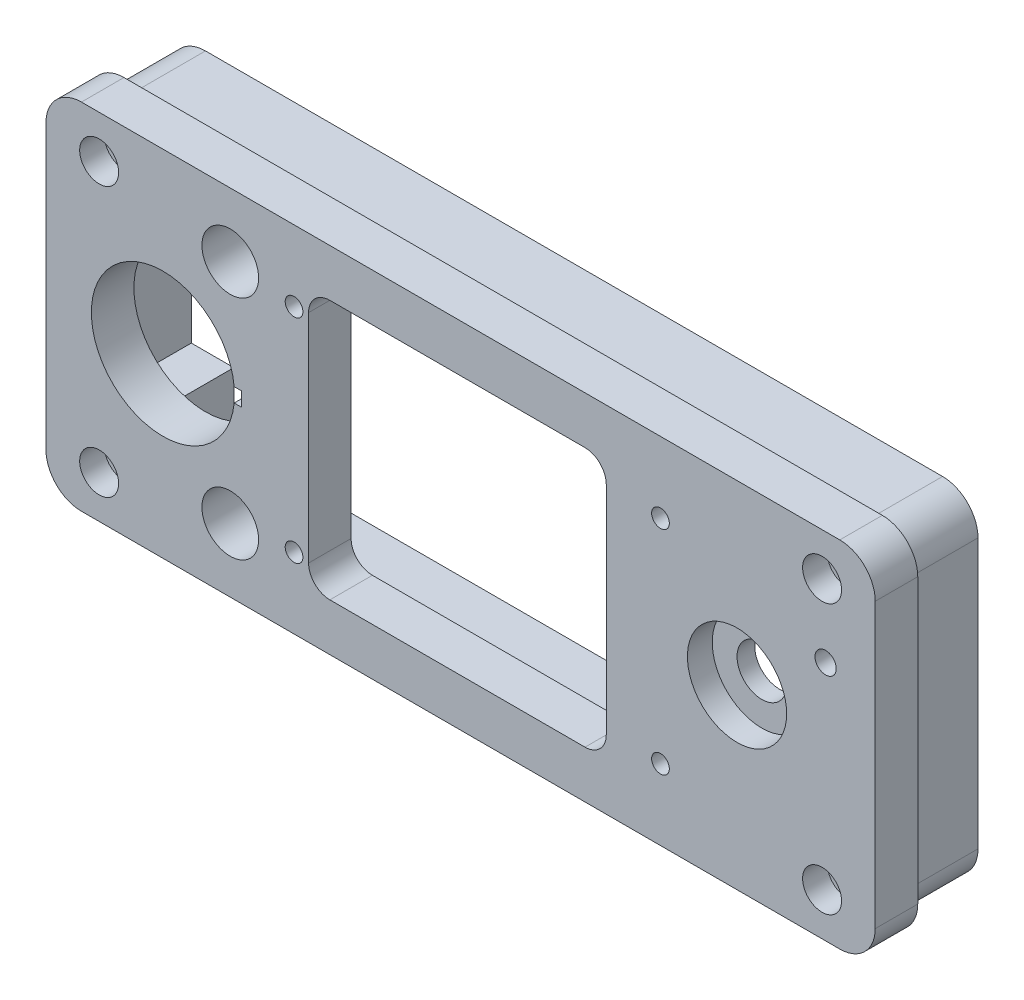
from build123d import *

# Parameters (mm, degrees)
SKETCH1_R           = 1.75
SKETCH1_R_2         = 3.5
SKETCH1_R_3         = 1.25000004
SKETCH1_R_4         = 1.25
SKETCH1_R_5         = 1.5
SKETCH1_R_6         = 4
BOSS_EXTRUDE1_DEPTH = 6
SKETCH2_R           = 2.75
SKETCH2_R_2         = 7
CUT_EXTRUDE1_DEPTH  = 3.5
BOSS_EXTRUDE2_DEPTH = 10


with BuildPart() as part:
    # Sketch1 → Boss-Extrude1 (new body)
    with BuildSketch(Plane.XY):
        with BuildLine():
            Line((5, 0), (112, 0))
            ThreePointArc((112, 0), (115.535533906, 1.464466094), (117, 5))
            Line((117, 5), (117, 45))
            ThreePointArc((117, 45), (115.535533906, 48.535533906), (112, 50))
            Line((112, 50), (5, 50))
            ThreePointArc((5, 50), (1.464466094, 48.535533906), (0, 45))
            Line((0, 45), (0, 5))
            ThreePointArc((0, 5), (1.464466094, 1.464466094), (5, 0))
        make_face()
        with Locations(Location((109.5, 44, 0), (0, 0, 180))):
            Circle(SKETCH1_R, mode=Mode.SUBTRACT)
        with Locations((7.5, 44)):
            Circle(SKETCH1_R, mode=Mode.SUBTRACT)
        with Locations((109.5, 6)):
            Circle(SKETCH1_R, mode=Mode.SUBTRACT)
        with Locations(Location((7.5, 6, 0), (0, 0, 180))):
            Circle(SKETCH1_R, mode=Mode.SUBTRACT)
        with Locations((97.500085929, 24.999938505)):
            Circle(SKETCH1_R_2, mode=Mode.SUBTRACT)
        with Locations((86.70040182, 40.00000238)):
            Circle(SKETCH1_R_3, mode=Mode.SUBTRACT)
        with Locations((86.70040182, 10.00000142)):
            Circle(SKETCH1_R_4, mode=Mode.SUBTRACT)
        with Locations((35.00040108, 10.00000142)):
            Circle(SKETCH1_R_4, mode=Mode.SUBTRACT)
        with Locations((35.00040108, 40.00000238)):
            Circle(SKETCH1_R_4, mode=Mode.SUBTRACT)
        with Locations((110, 34)):
            Circle(SKETCH1_R_5, mode=Mode.SUBTRACT)
        with Locations((26, 41)):
            Circle(SKETCH1_R_6, mode=Mode.SUBTRACT)
        with Locations(Location((26, 9, 0), (0, 0, 180))):
            Circle(SKETCH1_R_6, mode=Mode.SUBTRACT)
        with BuildLine():
            Line((40.050354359, 43.300060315), (76.050354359, 43.300060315))
            ThreePointArc((76.050354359, 43.300060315), (78.171674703, 42.421380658), (79.050354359, 40.300060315))
            Line((79.050354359, 40.300060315), (79.050354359, 9.700060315))
            ThreePointArc((79.050354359, 9.700060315), (78.171674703, 7.578739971), (76.050354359, 6.700060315))
            Line((76.050354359, 6.700060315), (40.050354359, 6.700060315))
            ThreePointArc((40.050354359, 6.700060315), (37.929034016, 7.578739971), (37.050354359, 9.700060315))
            Line((37.050354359, 9.700060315), (37.050354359, 40.300060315))
            ThreePointArc((37.050354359, 40.300060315), (37.929034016, 42.421380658), (40.050354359, 43.300060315))
        make_face(mode=Mode.SUBTRACT)
        with BuildLine():
            Line((27.550373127, 26), (26.550373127, 26))
            ThreePointArc((26.550373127, 26), (6.4, 25), (26.550373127, 24))
            Line((26.550373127, 24), (27.550373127, 24))
            Line((27.550373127, 24), (27.550373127, 26))
        make_face(mode=Mode.SUBTRACT)
    extrude(amount=BOSS_EXTRUDE1_DEPTH)

    # Sketch2 → Cut-Extrude1 (cut)
    with BuildSketch(Plane.XY.offset(6)):
        with Locations((7.5, 44)):
            Circle(SKETCH2_R)
        with Locations((7.5, 6)):
            Circle(SKETCH2_R)
        with Locations((109.5, 44)):
            Circle(SKETCH2_R)
        with Locations((109.5, 6)):
            Circle(SKETCH2_R)
        with Locations((97.500085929, 24.999938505)):
            Circle(SKETCH2_R_2)
    extrude(amount=-CUT_EXTRUDE1_DEPTH, mode=Mode.SUBTRACT)


with BuildPart() as body_2:
    # Sketch3 → Boss-Extrude2 (new body)
    with BuildSketch(Plane(origin=(0, 0, 0), x_dir=(-1, 0, 0), z_dir=(0, 0, -1))):
        with BuildLine():
            Line((-110.5, 1), (-6.5, 1))
            ThreePointArc((-6.5, 1), (-2.964466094, 2.464466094), (-1.5, 6))
            Line((-1.5, 6), (-1.5, 44))
            ThreePointArc((-1.5, 44), (-2.964466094, 47.535533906), (-6.5, 49))
            Line((-6.5, 49), (-110.5, 49))
            ThreePointArc((-110.5, 49), (-114.035533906, 47.535533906), (-115.5, 44))
            Line((-115.5, 44), (-115.5, 6))
            ThreePointArc((-115.5, 6), (-114.035533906, 2.464466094), (-110.5, 1))
        make_face()
        Polygon((-10.5, 2.8), (-10.5, 12.3), (-4.5, 12.3), (-4.5, 37.7), (-10.5, 37.7), (-10.5, 47.2), (-106.5, 47.2), (-106.5, 37.7), (-112.5, 37.7), (-112.5, 12.3), (-106.5, 12.3), (-106.5, 2.8), align=None, mode=Mode.SUBTRACT)
    extrude(amount=BOSS_EXTRUDE2_DEPTH)


solid = Compound([part.part, body_2.part])
